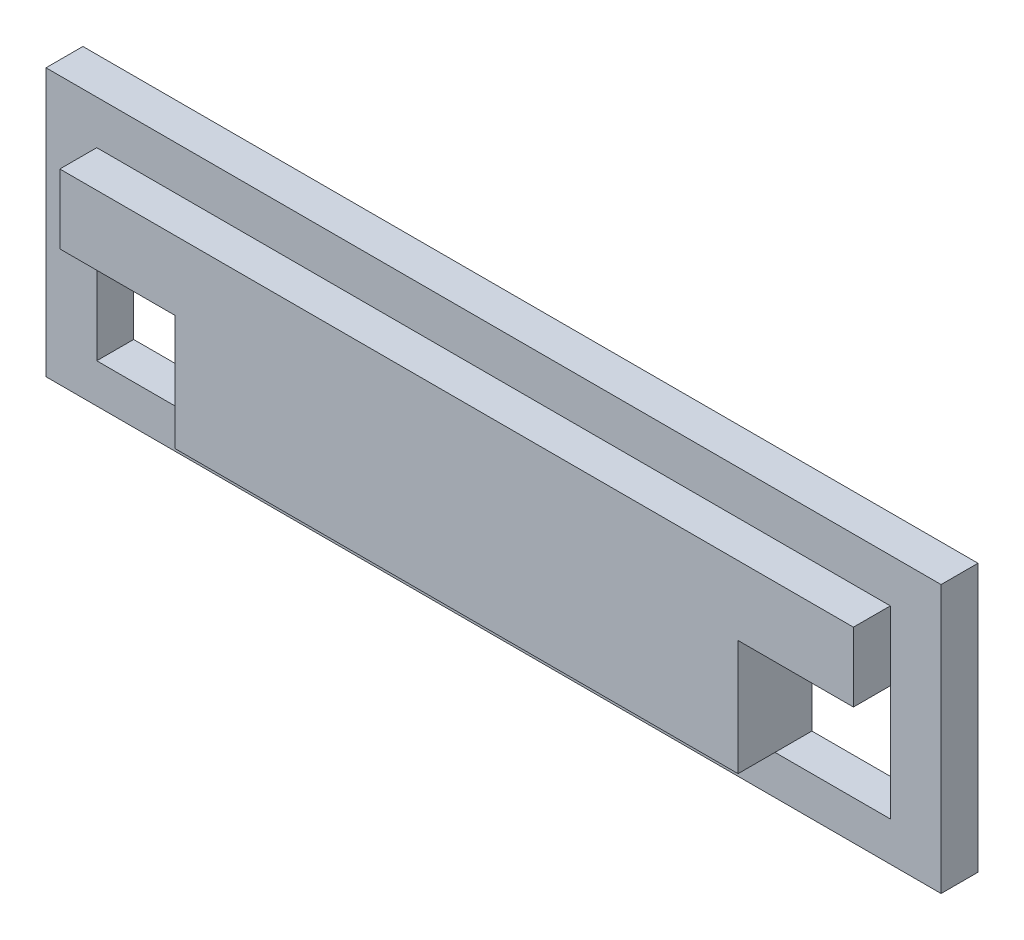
from build123d import *

# Parameters (mm, degrees)
SKETCH1_W           = 19.4
SKETCH1_H           = 5.8
BOSS_EXTRUDE1_DEPTH = 0.8
SKETCH2_W           = 17.2
SKETCH2_H           = 4
BOSS_EXTRUDE2_DEPTH = 0.8
SKETCH3_W           = 2.5
SKETCH3_H           = 2.5
CUT_EXTRUDE2_DEPTH  = 10.8


with BuildPart() as part:
    # Sketch1 → Boss-Extrude1 (new body)
    with BuildSketch(Plane.XY):
        with Locations((9.7, 2.9)):
            Rectangle(SKETCH1_W, SKETCH1_H)
    extrude(amount=BOSS_EXTRUDE1_DEPTH)

    # Sketch2 → Boss-Extrude2 (add)
    with BuildSketch(Plane.XY.offset(0.8)):
        with Locations((9.7, 2.85)):
            Rectangle(SKETCH2_W, SKETCH2_H)
    extrude(amount=BOSS_EXTRUDE2_DEPTH)

    # Sketch3 → Cut-Extrude2 (cut)
    with BuildSketch(Plane(origin=(0, 0, 0), x_dir=(-1, 0, 0), z_dir=(0, 0, -1))):
        with Locations((-17.05, 2.1)):
            Rectangle(SKETCH3_W, SKETCH3_H)
        with Locations((-2.35, 2.1)):
            Rectangle(SKETCH3_W, SKETCH3_H)
    extrude(amount=-CUT_EXTRUDE2_DEPTH, mode=Mode.SUBTRACT)


solid = part.part
